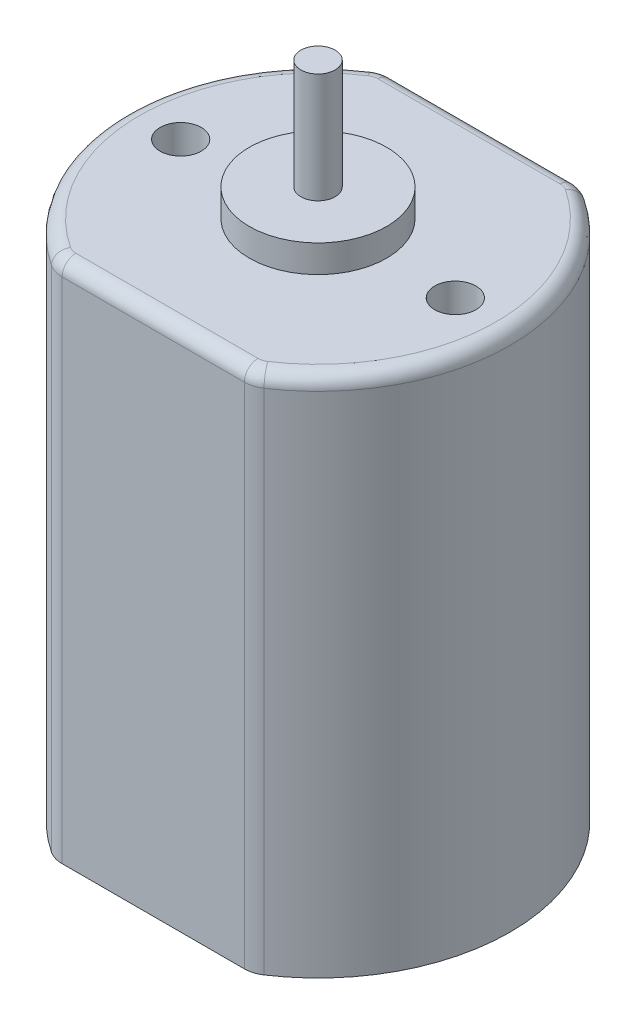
from build123d import *

# Parameters (mm, degrees)
EXTRUSION1_DEPTH        = 19
CONG_1_R                = 0.5
ESQUISSE2_R             = 2.5
EXTRUSION2_DEPTH        = 1
ESQUISSE3_R             = 0.625
EXTRUSION3_DEPTH        = 4
ESQUISSE4_R             = 0.75
ESQUISSE4_R_2           = 0.5
ENL_V_MAT_EXTRU_1_DEPTH = 2


with BuildPart() as part:
    # Esquisse1 → Extrusion1 (new body)
    with BuildSketch(Plane(origin=(0, 0, 0), x_dir=(1, 0, 0), z_dir=(0, 1, 0))):
        with BuildLine():
            Line((-3.31662479, -6), (3.31662479, -6))
            ThreePointArc((3.31662479, -6), (3.605299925, -5.957427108), (3.869395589, -5.833333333))
            ThreePointArc((3.869395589, -5.833333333), (7, 0), (3.869395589, 5.833333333))
            ThreePointArc((3.869395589, 5.833333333), (3.605299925, 5.957427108), (3.31662479, 6))
            Line((3.31662479, 6), (-3.31662479, 6))
            ThreePointArc((-3.31662479, 6), (-3.605299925, 5.957427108), (-3.869395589, 5.833333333))
            ThreePointArc((-3.869395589, 5.833333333), (-7, 0), (-3.869395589, -5.833333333))
            ThreePointArc((-3.869395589, -5.833333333), (-3.605299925, -5.957427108), (-3.31662479, -6))
        make_face()
    extrude(amount=EXTRUSION1_DEPTH)

    # Cong_1
    cong_1_edges = [part.edges().sort_by_distance(p)[0] for p in [
        (-3.605299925, 19, 5.957427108),
        (0, 19, 6),
        (3.605299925, 19, 5.957427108),
        (7, 19, 0),
        (3.605299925, 19, -5.957427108),
        (0, 19, -6),
        (-3.605299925, 19, -5.957427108),
        (-7, 19, 0),
    ]]
    fillet(cong_1_edges, radius=CONG_1_R)

    # Esquisse2 → Extrusion2 (add)
    with BuildSketch(Plane(origin=(0, 19, 0), x_dir=(-1, 0, 0), z_dir=(0, 1, 0))):
        with Locations(Location((0, 0, 0), (0, 0, 90))):
            Circle(ESQUISSE2_R)
    extrude(amount=EXTRUSION2_DEPTH)

    # Esquisse3 → Extrusion3 (add)
    with BuildSketch(Plane(origin=(0, 20, 0), x_dir=(-1, 0, 0), z_dir=(0, 1, 0))):
        with Locations(Location((0, 0, 0), (0, 0, 90))):
            Circle(ESQUISSE3_R)
    extrude(amount=EXTRUSION3_DEPTH)

    # Esquisse4 → Enl_v. mat.-Extru.1 (cut)
    with BuildSketch(Plane(origin=(0, 19, 0), x_dir=(-1, 0, 0), z_dir=(0, 1, 0))):
        with Locations(Location((-5, 0, 0), (0, 0, 90))):
            Circle(ESQUISSE4_R)
        with Locations(Location((3.535533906, -3.535533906, 0), (0, 0, 90))):
            Circle(ESQUISSE4_R_2)
        with Locations(Location((5, 0, 0), (0, 0, 90))):
            Circle(ESQUISSE4_R)
    extrude(amount=-ENL_V_MAT_EXTRU_1_DEPTH, mode=Mode.SUBTRACT)


solid = part.part
